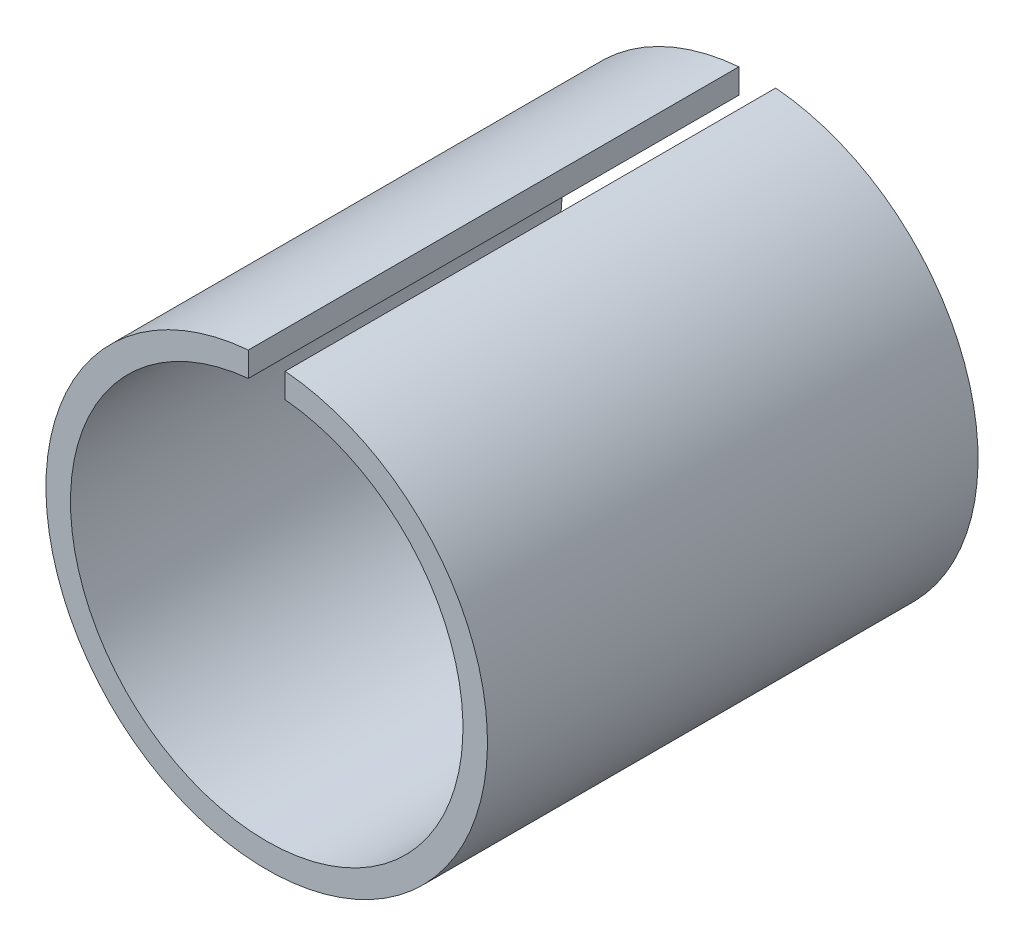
ISO-10303-21;
HEADER;
FILE_DESCRIPTION(('STEP AP214'),'2;1');
FILE_NAME('part.step','',(''),(''),'','','');
FILE_SCHEMA(('AUTOMOTIVE_DESIGN { 1 0 10303 214 1 1 1 1 }'));
ENDSEC;
DATA;
#1=APPLICATION_CONTEXT('core data for automotive mechanical design processes');
#2=APPLICATION_PROTOCOL_DEFINITION('international standard','automotive_design',2000,#1);
#3=PRODUCT_CONTEXT('',#1,'mechanical');
#4=PRODUCT('Part','Part','',(#3));
#5=PRODUCT_RELATED_PRODUCT_CATEGORY('part','',(#4));
#6=PRODUCT_DEFINITION_FORMATION('','',#4);
#7=PRODUCT_DEFINITION_CONTEXT('part definition',#1,'design');
#8=PRODUCT_DEFINITION('design','',#6,#7);
#9=PRODUCT_DEFINITION_SHAPE('','',#8);
#10=(LENGTH_UNIT() NAMED_UNIT(*) SI_UNIT(.MILLI.,.METRE.));
#11=(NAMED_UNIT(*) PLANE_ANGLE_UNIT() SI_UNIT($,.RADIAN.));
#12=(NAMED_UNIT(*) SI_UNIT($,.STERADIAN.) SOLID_ANGLE_UNIT());
#13=UNCERTAINTY_MEASURE_WITH_UNIT(LENGTH_MEASURE(1.E-05),#10,'distance_accuracy_value','');
#14=(GEOMETRIC_REPRESENTATION_CONTEXT(3) GLOBAL_UNCERTAINTY_ASSIGNED_CONTEXT((#13)) GLOBAL_UNIT_ASSIGNED_CONTEXT((#10,
#11,#12)) REPRESENTATION_CONTEXT('',''));
#15=CARTESIAN_POINT('',(0.,0.,0.));
#16=DIRECTION('',(0.,0.,1.));
#17=DIRECTION('',(1.,0.,0.));
#18=AXIS2_PLACEMENT_3D('',#15,#16,#17);
#19=CARTESIAN_POINT('',(0.750000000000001,10.5003856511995,-15.));
#20=DIRECTION('',(1.,0.,0.));
#21=DIRECTION('',(0.,1.,0.));
#22=AXIS2_PLACEMENT_3D('',#19,#20,#21);
#23=PLANE('',#22);
#24=DIRECTION('',(0.,0.,-1.));
#25=VECTOR('',#24,1.);
#26=CARTESIAN_POINT('',(0.750000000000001,7.964766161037,10.));
#27=LINE('',#26,#25);
#28=CARTESIAN_POINT('',(0.750000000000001,7.96476616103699,-10.));
#29=VERTEX_POINT('',#28);
#30=CARTESIAN_POINT('',(0.750000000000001,7.96476616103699,10.));
#31=VERTEX_POINT('',#30);
#32=EDGE_CURVE('E71',#29,#31,#27,.F.);
#33=ORIENTED_EDGE('',*,*,#32,.T.);
#34=DIRECTION('',(0.,1.,0.));
#35=VECTOR('',#34,1.);
#36=CARTESIAN_POINT('',(0.750000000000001,10.5003856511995,10.));
#37=LINE('',#36,#35);
#38=CARTESIAN_POINT('',(0.750000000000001,8.96869555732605,10.));
#39=VERTEX_POINT('',#38);
#40=EDGE_CURVE('E58',#39,#31,#37,.F.);
#41=ORIENTED_EDGE('',*,*,#40,.F.);
#42=DIRECTION('',(0.,0.,-1.));
#43=VECTOR('',#42,1.);
#44=CARTESIAN_POINT('',(0.750000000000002,8.96869555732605,10.));
#45=LINE('',#44,#43);
#46=CARTESIAN_POINT('',(0.750000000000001,8.96869555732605,-10.));
#47=VERTEX_POINT('',#46);
#48=EDGE_CURVE('E70',#47,#39,#45,.F.);
#49=ORIENTED_EDGE('',*,*,#48,.F.);
#50=DIRECTION('',(0.,1.,0.));
#51=VECTOR('',#50,1.);
#52=CARTESIAN_POINT('',(0.750000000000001,10.5003856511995,-10.));
#53=LINE('',#52,#51);
#54=EDGE_CURVE('E72',#29,#47,#53,.T.);
#55=ORIENTED_EDGE('',*,*,#54,.F.);
#56=EDGE_LOOP('',(#33,#41,#49,#55));
#57=FACE_BOUND('',#56,.T.);
#58=ADVANCED_FACE('F16',(#57),#23,.F.);
#59=CARTESIAN_POINT('',(-0.749999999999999,10.5003856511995,-15.));
#60=DIRECTION('',(-1.,0.,0.));
#61=DIRECTION('',(0.,-1.,0.));
#62=AXIS2_PLACEMENT_3D('',#59,#60,#61);
#63=PLANE('',#62);
#64=DIRECTION('',(0.,0.,-1.));
#65=VECTOR('',#64,1.);
#66=CARTESIAN_POINT('',(-0.749999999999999,7.964766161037,10.));
#67=LINE('',#66,#65);
#68=CARTESIAN_POINT('',(-0.749999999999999,7.964766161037,10.));
#69=VERTEX_POINT('',#68);
#70=CARTESIAN_POINT('',(-0.749999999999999,7.964766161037,-10.));
#71=VERTEX_POINT('',#70);
#72=EDGE_CURVE('E75',#69,#71,#67,.T.);
#73=ORIENTED_EDGE('',*,*,#72,.T.);
#74=DIRECTION('',(0.,-1.,0.));
#75=VECTOR('',#74,1.);
#76=CARTESIAN_POINT('',(-0.749999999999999,10.5003856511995,-10.));
#77=LINE('',#76,#75);
#78=CARTESIAN_POINT('',(-0.749999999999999,8.96869555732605,-10.));
#79=VERTEX_POINT('',#78);
#80=EDGE_CURVE('E82',#79,#71,#77,.T.);
#81=ORIENTED_EDGE('',*,*,#80,.F.);
#82=DIRECTION('',(0.,0.,-1.));
#83=VECTOR('',#82,1.);
#84=CARTESIAN_POINT('',(-0.749999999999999,8.96869555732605,10.));
#85=LINE('',#84,#83);
#86=CARTESIAN_POINT('',(-0.749999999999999,8.96869555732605,10.));
#87=VERTEX_POINT('',#86);
#88=EDGE_CURVE('E85',#87,#79,#85,.T.);
#89=ORIENTED_EDGE('',*,*,#88,.F.);
#90=DIRECTION('',(0.,1.,0.));
#91=VECTOR('',#90,1.);
#92=CARTESIAN_POINT('',(-0.749999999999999,0.,10.));
#93=LINE('',#92,#91);
#94=EDGE_CURVE('E60',#69,#87,#93,.T.);
#95=ORIENTED_EDGE('',*,*,#94,.F.);
#96=EDGE_LOOP('',(#73,#81,#89,#95));
#97=FACE_BOUND('',#96,.T.);
#98=ADVANCED_FACE('F88',(#97),#63,.F.);
#99=CARTESIAN_POINT('',(0.,0.,10.));
#100=DIRECTION('',(0.,0.,-1.));
#101=DIRECTION('',(-1.,0.,0.));
#102=AXIS2_PLACEMENT_3D('',#99,#100,#101);
#103=CYLINDRICAL_SURFACE('',#102,8.);
#104=CARTESIAN_POINT('',(0.,0.,10.));
#105=DIRECTION('',(0.,0.,-1.));
#106=DIRECTION('',(-1.,0.,0.));
#107=AXIS2_PLACEMENT_3D('',#104,#105,#106);
#108=CIRCLE('',#107,8.);
#109=EDGE_CURVE('E19',#31,#69,#108,.T.);
#110=ORIENTED_EDGE('',*,*,#109,.F.);
#111=ORIENTED_EDGE('',*,*,#32,.F.);
#112=CARTESIAN_POINT('',(0.,0.,-10.));
#113=DIRECTION('',(0.,0.,-1.));
#114=DIRECTION('',(-1.,0.,0.));
#115=AXIS2_PLACEMENT_3D('',#112,#113,#114);
#116=CIRCLE('',#115,8.);
#117=EDGE_CURVE('E65',#29,#71,#116,.T.);
#118=ORIENTED_EDGE('',*,*,#117,.T.);
#119=ORIENTED_EDGE('',*,*,#72,.F.);
#120=EDGE_LOOP('',(#110,#111,#118,#119));
#121=FACE_BOUND('',#120,.T.);
#122=ADVANCED_FACE('F90',(#121),#103,.F.);
#123=CARTESIAN_POINT('',(0.,0.,10.));
#124=DIRECTION('',(0.,0.,1.));
#125=DIRECTION('',(1.,0.,0.));
#126=AXIS2_PLACEMENT_3D('',#123,#124,#125);
#127=PLANE('',#126);
#128=ORIENTED_EDGE('',*,*,#40,.T.);
#129=ORIENTED_EDGE('',*,*,#109,.T.);
#130=ORIENTED_EDGE('',*,*,#94,.T.);
#131=CARTESIAN_POINT('',(0.,0.,10.));
#132=DIRECTION('',(0.,0.,-1.));
#133=DIRECTION('',(-1.,0.,0.));
#134=AXIS2_PLACEMENT_3D('',#131,#132,#133);
#135=CIRCLE('',#134,9.);
#136=EDGE_CURVE('E25',#39,#87,#135,.T.);
#137=ORIENTED_EDGE('',*,*,#136,.F.);
#138=EDGE_LOOP('',(#128,#129,#130,#137));
#139=FACE_BOUND('',#138,.T.);
#140=ADVANCED_FACE('F57',(#139),#127,.T.);
#141=CARTESIAN_POINT('',(0.,0.,-10.));
#142=DIRECTION('',(0.,0.,1.));
#143=DIRECTION('',(1.,0.,0.));
#144=AXIS2_PLACEMENT_3D('',#141,#142,#143);
#145=PLANE('',#144);
#146=ORIENTED_EDGE('',*,*,#80,.T.);
#147=ORIENTED_EDGE('',*,*,#117,.F.);
#148=ORIENTED_EDGE('',*,*,#54,.T.);
#149=CARTESIAN_POINT('',(0.,0.,-10.));
#150=DIRECTION('',(0.,0.,-1.));
#151=DIRECTION('',(-1.,0.,0.));
#152=AXIS2_PLACEMENT_3D('',#149,#150,#151);
#153=CIRCLE('',#152,9.);
#154=EDGE_CURVE('E11',#79,#47,#153,.F.);
#155=ORIENTED_EDGE('',*,*,#154,.F.);
#156=EDGE_LOOP('',(#146,#147,#148,#155));
#157=FACE_BOUND('',#156,.T.);
#158=ADVANCED_FACE('F89',(#157),#145,.F.);
#159=CARTESIAN_POINT('',(0.,0.,10.));
#160=DIRECTION('',(0.,0.,-1.));
#161=DIRECTION('',(-1.,0.,0.));
#162=AXIS2_PLACEMENT_3D('',#159,#160,#161);
#163=CYLINDRICAL_SURFACE('',#162,9.);
#164=ORIENTED_EDGE('',*,*,#136,.T.);
#165=ORIENTED_EDGE('',*,*,#88,.T.);
#166=ORIENTED_EDGE('',*,*,#154,.T.);
#167=ORIENTED_EDGE('',*,*,#48,.T.);
#168=EDGE_LOOP('',(#164,#165,#166,#167));
#169=FACE_BOUND('',#168,.T.);
#170=ADVANCED_FACE('F74',(#169),#163,.T.);
#171=CLOSED_SHELL('',(#58,#98,#122,#140,#158,#170));
#172=MANIFOLD_SOLID_BREP('B1',#171);
#173=ADVANCED_BREP_SHAPE_REPRESENTATION('',(#18,#172),#14);
#174=SHAPE_DEFINITION_REPRESENTATION(#9,#173);
ENDSEC;
END-ISO-10303-21;
